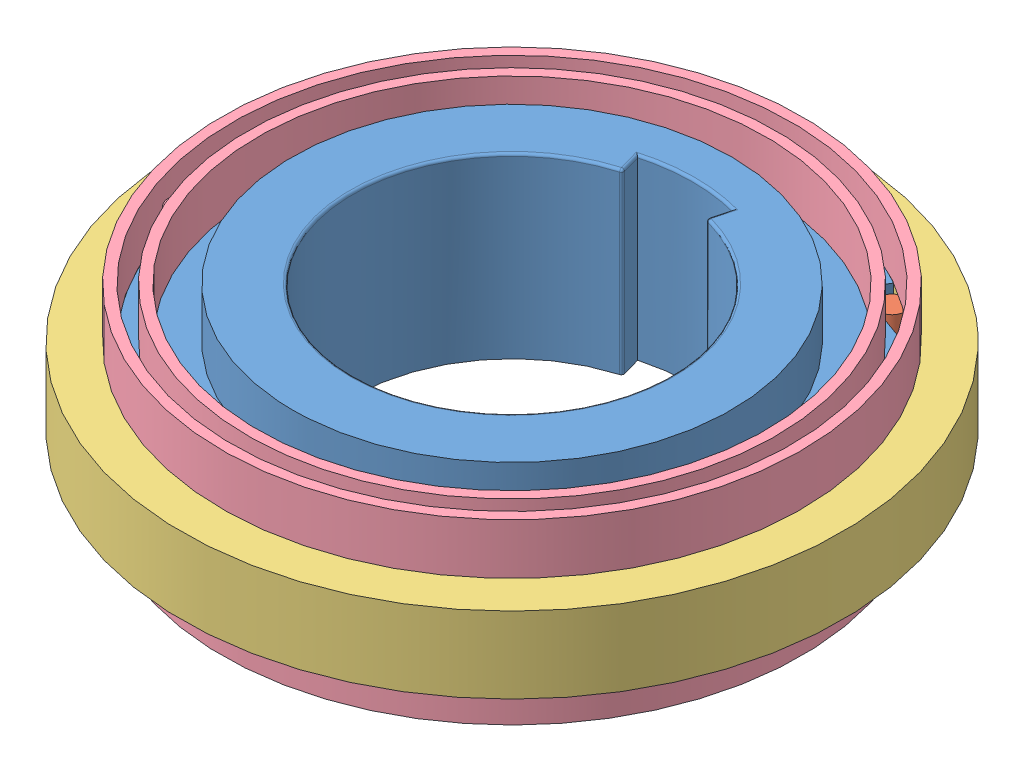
SolidWorks assembly Assem1.SLDASM, configuration Default (file format 12000). Lengths in mm.
Overall size (366.91 70.09 366.91).
10 component instances, 4 part files, 6 mates.
Components (placement in the parent):
- Part1-1: Part1.SLDPRT [Default] at (53.0343 115.9021 173.253) size (220 70.09 220)
- Part2-1: Part2.SLDPRT [Default] at (159.9272 130.9021 183.1287) x (-0.218439 0 -0.975851) z (0.975851 0 -0.218439) size (16.45 30 10)
- Part2-7: Part2.SLDPRT [Default] at (115.0334 130.9021 85.6189) x (-0.954331 0 -0.298752) z (0.298752 0 -0.954331) size (16.45 30 10)
- Part2-8: Part2.SLDPRT [Default] at (8.1405 130.9021 75.7431) x (-0.735892 0 0.677099) z (-0.677099 0 -0.735892) size (16.45 30 10)
- Part2-9: Part2.SLDPRT [Default] at (-53.8586 130.9021 163.3772) x (0.218439 0 0.975851) z (-0.975851 0 0.218439) size (16.45 30 10)
- Part2-10: Part2.SLDPRT [Default] at (-8.9648 130.9021 260.887) x (0.954331 0 0.298752) z (-0.298752 0 0.954331) size (16.45 30 10)
- Part2-11: Part2.SLDPRT [Default] at (97.9281 130.9021 270.7628) x (0.735892 0 -0.677099) z (0.677099 0 0.735892) size (16.45 30 10)
- Part4-2: Part4.SLDPRT [Default] at (202.9791 115.9021 -328.7012) x (-0.728311 0 -0.685247) z (0.685247 0 -0.728311) size (259.57 30 259.57)
- Part3-1: Part3.SLDPRT [Default] at (53.0343 155.9021 173.253) x (0.729348 0 0.684143) z (-0.684143 0 0.729348) size (228 20 228)
- Part3-3: Part3.SLDPRT [Default] at (53.0343 105.9021 173.253) x (0.729348 0 0.684143) z (0.684143 0 -0.729348) size (228 20 228)
Mates (geometry in assembly coordinates):
- Tangent1: tangent: plane of Part1-1 through (153.0343 145.9021 173.253) normal (0.983623 0 -0.180239); cylinder of Part2-1 through (159.9272 145.9021 183.1287) axis (0 -1 0) radius 5
- Coincident1: coincident aligned: plane of Part1-1 through (74.6207 145.9021 270.8953) normal (0 1 0); plane of Part2-1 through (159.9272 145.9021 183.1287) normal (0 1 0)
- Concentric3: concentric: cylinder of Part1-1 through (53.0343 145.9021 173.253) axis (0 -1 0) radius 110; cylinder of Part4-2 through (53.0343 145.9021 173.253) axis (0 -1 0) radius 112.884
- Coincident2: coincident aligned: plane of Part1-1 through (74.6207 145.9021 270.8953) normal (0 1 0); plane of Part4-2 through (53.0343 145.9021 173.253) normal (0 1 0)
- Concentric2: concentric anti-aligned: circle of Part4-2; circle of Part3-1
- Coincident6: coincident anti-aligned: plane of Part1-1 through (74.6207 145.9021 270.8953) normal (0 1 0); circle of Part3-1
